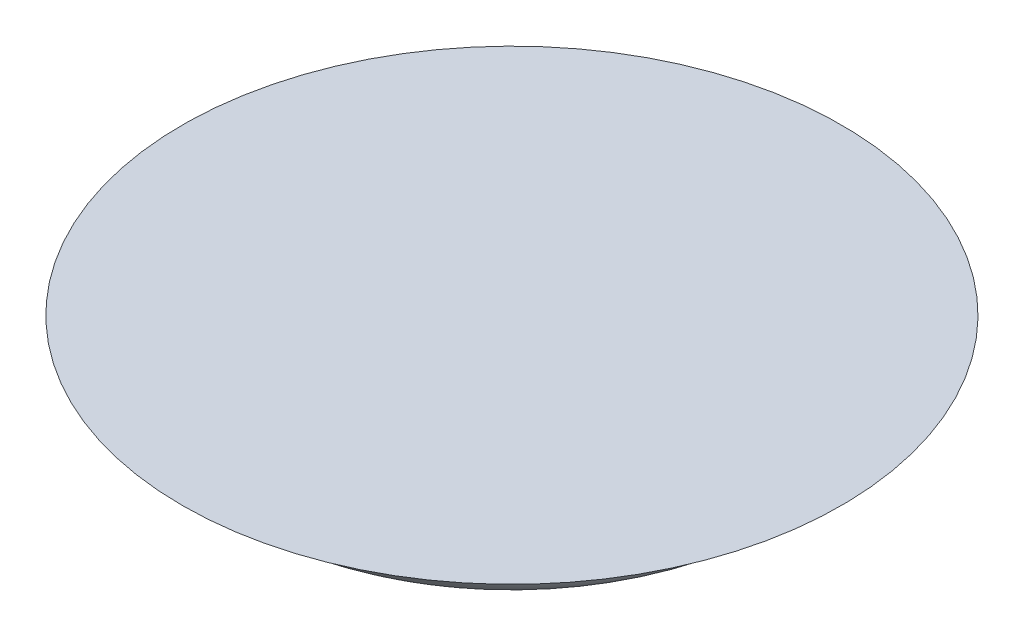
from build123d import *

# Parameters (mm, degrees)
SKETCH1_W           = 203.69051182
SKETCH1_H           = 2
BASE_EXTRUDE_DEPTH  = 60
SKETCH3_R           = 25
BOSS_EXTRUDE1_DEPTH = 5
FILLET_2_R          = 3
FILLET2_R           = 5
SKETCH4_W           = 120
SKETCH4_H           = 2
CUT_EXTRUDE1_DEPTH  = 213.402506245


with BuildPart() as part:
    # Sketch1 → Base-Extrude (new, symmetric)
    with BuildSketch(Plane.XY):
        with Locations((0, 1)):
            Rectangle(SKETCH1_W, SKETCH1_H)
    extrude(amount=BASE_EXTRUDE_DEPTH, both=True)

    # Sketch3 → Boss-Extrude1 (add)
    with BuildSketch(Plane.XZ):
        with Locations(Location((0, 0, 0), (0, 0, 90))):
            Circle(SKETCH3_R)
    extrude(amount=BOSS_EXTRUDE1_DEPTH)

    # Fillet 2
    fillet_2_edges = [part.edges().sort_by_distance(p)[0] for p in [
        (0, -5, -25),
    ]]
    fillet(fillet_2_edges, radius=FILLET_2_R)

    # Fillet2
    fillet2_edges = [part.edges().sort_by_distance(p)[0] for p in [
        (0, 0, -25),
    ]]
    fillet(fillet2_edges, radius=FILLET2_R)

    # Sketch4 → Cut-Extrude1 (cut, through all)
    with BuildSketch(Plane(origin=(101.84525591, 0, 0), x_dir=(0, 0, -1), z_dir=(1, 0, 0))):
        with Locations((0, 1)):
            Rectangle(SKETCH4_W, SKETCH4_H)
    extrude(amount=-CUT_EXTRUDE1_DEPTH, mode=Mode.SUBTRACT)


solid = part.part
